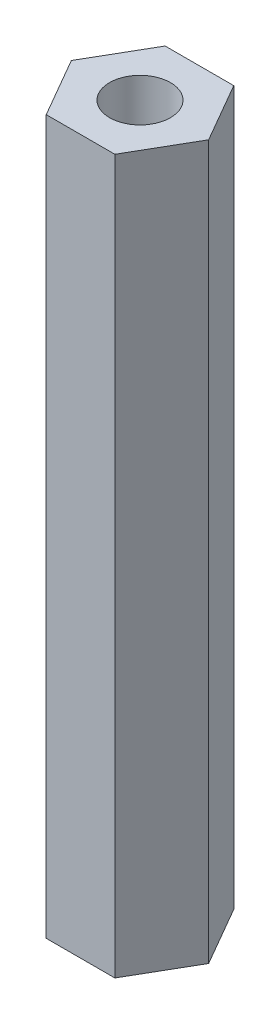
ISO-10303-21;
HEADER;
FILE_DESCRIPTION(('STEP AP214'),'2;1');
FILE_NAME('part.step','',(''),(''),'','','');
FILE_SCHEMA(('AUTOMOTIVE_DESIGN { 1 0 10303 214 1 1 1 1 }'));
ENDSEC;
DATA;
#1=APPLICATION_CONTEXT('core data for automotive mechanical design processes');
#2=APPLICATION_PROTOCOL_DEFINITION('international standard','automotive_design',2000,#1);
#3=PRODUCT_CONTEXT('',#1,'mechanical');
#4=PRODUCT('Part','Part','',(#3));
#5=PRODUCT_RELATED_PRODUCT_CATEGORY('part','',(#4));
#6=PRODUCT_DEFINITION_FORMATION('','',#4);
#7=PRODUCT_DEFINITION_CONTEXT('part definition',#1,'design');
#8=PRODUCT_DEFINITION('design','',#6,#7);
#9=PRODUCT_DEFINITION_SHAPE('','',#8);
#10=(LENGTH_UNIT() NAMED_UNIT(*) SI_UNIT(.MILLI.,.METRE.));
#11=(NAMED_UNIT(*) PLANE_ANGLE_UNIT() SI_UNIT($,.RADIAN.));
#12=(NAMED_UNIT(*) SI_UNIT($,.STERADIAN.) SOLID_ANGLE_UNIT());
#13=UNCERTAINTY_MEASURE_WITH_UNIT(LENGTH_MEASURE(1.E-05),#10,'distance_accuracy_value','');
#14=(GEOMETRIC_REPRESENTATION_CONTEXT(3) GLOBAL_UNCERTAINTY_ASSIGNED_CONTEXT((#13)) GLOBAL_UNIT_ASSIGNED_CONTEXT((#10,
#11,#12)) REPRESENTATION_CONTEXT('',''));
#15=CARTESIAN_POINT('',(0.,0.,0.));
#16=DIRECTION('',(0.,0.,1.));
#17=DIRECTION('',(1.,0.,0.));
#18=AXIS2_PLACEMENT_3D('',#15,#16,#17);
#19=CARTESIAN_POINT('',(0.,38.1,0.));
#20=DIRECTION('',(0.,1.,0.));
#21=DIRECTION('',(0.,0.,1.));
#22=AXIS2_PLACEMENT_3D('',#19,#20,#21);
#23=PLANE('',#22);
#24=DIRECTION('',(-0.500000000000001,0.,-0.866025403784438));
#25=VECTOR('',#24,1.);
#26=CARTESIAN_POINT('',(3.66617420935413,38.1,0.));
#27=LINE('',#26,#25);
#28=CARTESIAN_POINT('',(3.66617420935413,38.1,0.));
#29=VERTEX_POINT('',#28);
#30=CARTESIAN_POINT('',(1.83308710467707,38.1,-3.175));
#31=VERTEX_POINT('',#30);
#32=EDGE_CURVE('E129',#29,#31,#27,.T.);
#33=ORIENTED_EDGE('',*,*,#32,.T.);
#34=DIRECTION('',(-1.,0.,0.));
#35=VECTOR('',#34,1.);
#36=CARTESIAN_POINT('',(1.83308710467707,38.1,-3.175));
#37=LINE('',#36,#35);
#38=CARTESIAN_POINT('',(-1.83308710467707,38.1,-3.175));
#39=VERTEX_POINT('',#38);
#40=EDGE_CURVE('E87',#31,#39,#37,.T.);
#41=ORIENTED_EDGE('',*,*,#40,.T.);
#42=DIRECTION('',(-0.500000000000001,0.,0.866025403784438));
#43=VECTOR('',#42,1.);
#44=CARTESIAN_POINT('',(-1.83308710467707,38.1,-3.175));
#45=LINE('',#44,#43);
#46=CARTESIAN_POINT('',(-3.66617420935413,38.1,0.));
#47=VERTEX_POINT('',#46);
#48=EDGE_CURVE('E100',#39,#47,#45,.T.);
#49=ORIENTED_EDGE('',*,*,#48,.T.);
#50=DIRECTION('',(0.5,0.,0.866025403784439));
#51=VECTOR('',#50,1.);
#52=CARTESIAN_POINT('',(-3.66617420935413,38.1,0.));
#53=LINE('',#52,#51);
#54=CARTESIAN_POINT('',(-1.83308710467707,38.1,3.175));
#55=VERTEX_POINT('',#54);
#56=EDGE_CURVE('E94',#47,#55,#53,.T.);
#57=ORIENTED_EDGE('',*,*,#56,.T.);
#58=DIRECTION('',(1.,0.,0.));
#59=VECTOR('',#58,1.);
#60=CARTESIAN_POINT('',(-1.83308710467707,38.1,3.175));
#61=LINE('',#60,#59);
#62=CARTESIAN_POINT('',(1.83308710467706,38.1,3.175));
#63=VERTEX_POINT('',#62);
#64=EDGE_CURVE('E98',#55,#63,#61,.T.);
#65=ORIENTED_EDGE('',*,*,#64,.T.);
#66=DIRECTION('',(0.500000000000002,0.,-0.866025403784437));
#67=VECTOR('',#66,1.);
#68=CARTESIAN_POINT('',(1.83308710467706,38.1,3.175));
#69=LINE('',#68,#67);
#70=EDGE_CURVE('E50',#63,#29,#69,.T.);
#71=ORIENTED_EDGE('',*,*,#70,.T.);
#72=EDGE_LOOP('',(#33,#41,#49,#57,#65,#71));
#73=FACE_BOUND('',#72,.T.);
#74=CARTESIAN_POINT('',(0.,38.1,0.));
#75=DIRECTION('',(0.,1.,0.));
#76=DIRECTION('',(0.,0.,1.));
#77=AXIS2_PLACEMENT_3D('',#74,#75,#76);
#78=CIRCLE('',#77,1.6256);
#79=CARTESIAN_POINT('',(0.,38.1,-1.6256));
#80=VERTEX_POINT('',#79);
#81=EDGE_CURVE('E122',#80,#80,#78,.T.);
#82=ORIENTED_EDGE('',*,*,#81,.F.);
#83=EDGE_LOOP('',(#82));
#84=FACE_BOUND('',#83,.T.);
#85=ADVANCED_FACE('F33',(#73,#84),#23,.T.);
#86=CARTESIAN_POINT('',(0.,0.,0.));
#87=DIRECTION('',(0.,1.,0.));
#88=DIRECTION('',(0.,0.,1.));
#89=AXIS2_PLACEMENT_3D('',#86,#87,#88);
#90=PLANE('',#89);
#91=DIRECTION('',(-0.500000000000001,0.,-0.866025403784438));
#92=VECTOR('',#91,1.);
#93=CARTESIAN_POINT('',(3.66617420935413,0.,0.));
#94=LINE('',#93,#92);
#95=CARTESIAN_POINT('',(3.66617420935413,0.,0.));
#96=VERTEX_POINT('',#95);
#97=CARTESIAN_POINT('',(1.83308710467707,0.,-3.175));
#98=VERTEX_POINT('',#97);
#99=EDGE_CURVE('E118',#96,#98,#94,.T.);
#100=ORIENTED_EDGE('',*,*,#99,.F.);
#101=DIRECTION('',(0.500000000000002,0.,-0.866025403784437));
#102=VECTOR('',#101,1.);
#103=CARTESIAN_POINT('',(1.83308710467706,0.,3.175));
#104=LINE('',#103,#102);
#105=CARTESIAN_POINT('',(1.83308710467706,0.,3.175));
#106=VERTEX_POINT('',#105);
#107=EDGE_CURVE('E79',#106,#96,#104,.T.);
#108=ORIENTED_EDGE('',*,*,#107,.F.);
#109=DIRECTION('',(1.,0.,0.));
#110=VECTOR('',#109,1.);
#111=CARTESIAN_POINT('',(-1.83308710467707,0.,3.175));
#112=LINE('',#111,#110);
#113=CARTESIAN_POINT('',(-1.83308710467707,0.,3.175));
#114=VERTEX_POINT('',#113);
#115=EDGE_CURVE('E73',#114,#106,#112,.T.);
#116=ORIENTED_EDGE('',*,*,#115,.F.);
#117=DIRECTION('',(0.5,0.,0.866025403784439));
#118=VECTOR('',#117,1.);
#119=CARTESIAN_POINT('',(-3.66617420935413,0.,0.));
#120=LINE('',#119,#118);
#121=CARTESIAN_POINT('',(-3.66617420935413,0.,0.));
#122=VERTEX_POINT('',#121);
#123=EDGE_CURVE('E108',#122,#114,#120,.T.);
#124=ORIENTED_EDGE('',*,*,#123,.F.);
#125=DIRECTION('',(-0.500000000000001,0.,0.866025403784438));
#126=VECTOR('',#125,1.);
#127=CARTESIAN_POINT('',(-1.83308710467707,0.,-3.175));
#128=LINE('',#127,#126);
#129=CARTESIAN_POINT('',(-1.83308710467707,0.,-3.175));
#130=VERTEX_POINT('',#129);
#131=EDGE_CURVE('E124',#130,#122,#128,.T.);
#132=ORIENTED_EDGE('',*,*,#131,.F.);
#133=DIRECTION('',(-1.,0.,0.));
#134=VECTOR('',#133,1.);
#135=CARTESIAN_POINT('',(1.83308710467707,0.,-3.175));
#136=LINE('',#135,#134);
#137=EDGE_CURVE('E121',#98,#130,#136,.T.);
#138=ORIENTED_EDGE('',*,*,#137,.F.);
#139=EDGE_LOOP('',(#100,#108,#116,#124,#132,#138));
#140=FACE_BOUND('',#139,.T.);
#141=CARTESIAN_POINT('',(0.,0.,0.));
#142=DIRECTION('',(0.,1.,0.));
#143=DIRECTION('',(0.,0.,1.));
#144=AXIS2_PLACEMENT_3D('',#141,#142,#143);
#145=CIRCLE('',#144,1.6256);
#146=CARTESIAN_POINT('',(0.,0.,-1.6256));
#147=VERTEX_POINT('',#146);
#148=EDGE_CURVE('E222',#147,#147,#145,.T.);
#149=ORIENTED_EDGE('',*,*,#148,.T.);
#150=EDGE_LOOP('',(#149));
#151=FACE_BOUND('',#150,.T.);
#152=ADVANCED_FACE('F138',(#140,#151),#90,.F.);
#153=CARTESIAN_POINT('',(3.66617420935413,38.1,0.));
#154=DIRECTION('',(-0.866025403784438,0.,0.500000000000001));
#155=DIRECTION('',(0.500000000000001,0.,0.866025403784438));
#156=AXIS2_PLACEMENT_3D('',#153,#154,#155);
#157=PLANE('',#156);
#158=ORIENTED_EDGE('',*,*,#99,.T.);
#159=DIRECTION('',(0.,-1.,0.));
#160=VECTOR('',#159,1.);
#161=CARTESIAN_POINT('',(1.83308710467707,38.1,-3.175));
#162=LINE('',#161,#160);
#163=EDGE_CURVE('E11',#31,#98,#162,.T.);
#164=ORIENTED_EDGE('',*,*,#163,.F.);
#165=ORIENTED_EDGE('',*,*,#32,.F.);
#166=DIRECTION('',(0.,-1.,0.));
#167=VECTOR('',#166,1.);
#168=CARTESIAN_POINT('',(3.66617420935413,38.1,0.));
#169=LINE('',#168,#167);
#170=EDGE_CURVE('E114',#29,#96,#169,.T.);
#171=ORIENTED_EDGE('',*,*,#170,.T.);
#172=EDGE_LOOP('',(#158,#164,#165,#171));
#173=FACE_BOUND('',#172,.T.);
#174=ADVANCED_FACE('F35',(#173),#157,.F.);
#175=CARTESIAN_POINT('',(1.83308710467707,38.1,-3.175));
#176=DIRECTION('',(0.,0.,1.));
#177=DIRECTION('',(1.,0.,0.));
#178=AXIS2_PLACEMENT_3D('',#175,#176,#177);
#179=PLANE('',#178);
#180=ORIENTED_EDGE('',*,*,#137,.T.);
#181=DIRECTION('',(0.,-1.,0.));
#182=VECTOR('',#181,1.);
#183=CARTESIAN_POINT('',(-1.83308710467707,38.1,-3.175));
#184=LINE('',#183,#182);
#185=EDGE_CURVE('E42',#39,#130,#184,.T.);
#186=ORIENTED_EDGE('',*,*,#185,.F.);
#187=ORIENTED_EDGE('',*,*,#40,.F.);
#188=ORIENTED_EDGE('',*,*,#163,.T.);
#189=EDGE_LOOP('',(#180,#186,#187,#188));
#190=FACE_BOUND('',#189,.T.);
#191=ADVANCED_FACE('F163',(#190),#179,.F.);
#192=CARTESIAN_POINT('',(-1.83308710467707,38.1,-3.175));
#193=DIRECTION('',(0.866025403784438,0.,0.500000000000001));
#194=DIRECTION('',(0.500000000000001,0.,-0.866025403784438));
#195=AXIS2_PLACEMENT_3D('',#192,#193,#194);
#196=PLANE('',#195);
#197=ORIENTED_EDGE('',*,*,#131,.T.);
#198=DIRECTION('',(0.,-1.,0.));
#199=VECTOR('',#198,1.);
#200=CARTESIAN_POINT('',(-3.66617420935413,38.1,0.));
#201=LINE('',#200,#199);
#202=EDGE_CURVE('E109',#47,#122,#201,.T.);
#203=ORIENTED_EDGE('',*,*,#202,.F.);
#204=ORIENTED_EDGE('',*,*,#48,.F.);
#205=ORIENTED_EDGE('',*,*,#185,.T.);
#206=EDGE_LOOP('',(#197,#203,#204,#205));
#207=FACE_BOUND('',#206,.T.);
#208=ADVANCED_FACE('F135',(#207),#196,.F.);
#209=CARTESIAN_POINT('',(-3.66617420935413,38.1,0.));
#210=DIRECTION('',(0.866025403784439,0.,-0.5));
#211=DIRECTION('',(-0.5,0.,-0.866025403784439));
#212=AXIS2_PLACEMENT_3D('',#209,#210,#211);
#213=PLANE('',#212);
#214=ORIENTED_EDGE('',*,*,#123,.T.);
#215=DIRECTION('',(0.,-1.,0.));
#216=VECTOR('',#215,1.);
#217=CARTESIAN_POINT('',(-1.83308710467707,38.1,3.175));
#218=LINE('',#217,#216);
#219=EDGE_CURVE('E105',#55,#114,#218,.T.);
#220=ORIENTED_EDGE('',*,*,#219,.F.);
#221=ORIENTED_EDGE('',*,*,#56,.F.);
#222=ORIENTED_EDGE('',*,*,#202,.T.);
#223=EDGE_LOOP('',(#214,#220,#221,#222));
#224=FACE_BOUND('',#223,.T.);
#225=ADVANCED_FACE('F106',(#224),#213,.F.);
#226=CARTESIAN_POINT('',(-1.83308710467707,38.1,3.175));
#227=DIRECTION('',(0.,0.,-1.));
#228=DIRECTION('',(-1.,0.,0.));
#229=AXIS2_PLACEMENT_3D('',#226,#227,#228);
#230=PLANE('',#229);
#231=ORIENTED_EDGE('',*,*,#115,.T.);
#232=DIRECTION('',(0.,-1.,0.));
#233=VECTOR('',#232,1.);
#234=CARTESIAN_POINT('',(1.83308710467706,38.1,3.175));
#235=LINE('',#234,#233);
#236=EDGE_CURVE('E110',#63,#106,#235,.T.);
#237=ORIENTED_EDGE('',*,*,#236,.F.);
#238=ORIENTED_EDGE('',*,*,#64,.F.);
#239=ORIENTED_EDGE('',*,*,#219,.T.);
#240=EDGE_LOOP('',(#231,#237,#238,#239));
#241=FACE_BOUND('',#240,.T.);
#242=ADVANCED_FACE('F112',(#241),#230,.F.);
#243=CARTESIAN_POINT('',(1.83308710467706,38.1,3.175));
#244=DIRECTION('',(-0.866025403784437,0.,-0.500000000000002));
#245=DIRECTION('',(-0.500000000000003,0.,0.866025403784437));
#246=AXIS2_PLACEMENT_3D('',#243,#244,#245);
#247=PLANE('',#246);
#248=ORIENTED_EDGE('',*,*,#107,.T.);
#249=ORIENTED_EDGE('',*,*,#170,.F.);
#250=ORIENTED_EDGE('',*,*,#70,.F.);
#251=ORIENTED_EDGE('',*,*,#236,.T.);
#252=EDGE_LOOP('',(#248,#249,#250,#251));
#253=FACE_BOUND('',#252,.T.);
#254=ADVANCED_FACE('F143',(#253),#247,.F.);
#255=CARTESIAN_POINT('',(0.,38.1,0.));
#256=DIRECTION('',(0.,-1.,0.));
#257=DIRECTION('',(0.,0.,-1.));
#258=AXIS2_PLACEMENT_3D('',#255,#256,#257);
#259=CYLINDRICAL_SURFACE('',#258,1.6256);
#260=CARTESIAN_POINT('',(0.,38.1,-1.6256));
#261=CARTESIAN_POINT('',(0.,37.703125,-1.6256));
#262=CARTESIAN_POINT('',(0.,37.30625,-1.6256));
#263=CARTESIAN_POINT('',(0.,36.5125,-1.6256));
#264=CARTESIAN_POINT('',(0.,36.115625,-1.6256));
#265=CARTESIAN_POINT('',(0.,35.321875,-1.6256));
#266=CARTESIAN_POINT('',(0.,34.925,-1.6256));
#267=CARTESIAN_POINT('',(0.,34.13125,-1.6256));
#268=CARTESIAN_POINT('',(0.,33.734375,-1.6256));
#269=CARTESIAN_POINT('',(0.,32.940625,-1.6256));
#270=CARTESIAN_POINT('',(0.,32.54375,-1.6256));
#271=CARTESIAN_POINT('',(0.,31.75,-1.6256));
#272=CARTESIAN_POINT('',(0.,31.353125,-1.6256));
#273=CARTESIAN_POINT('',(0.,30.559375,-1.6256));
#274=CARTESIAN_POINT('',(0.,30.1625,-1.6256));
#275=CARTESIAN_POINT('',(0.,29.36875,-1.6256));
#276=CARTESIAN_POINT('',(0.,28.971875,-1.6256));
#277=CARTESIAN_POINT('',(0.,28.178125,-1.6256));
#278=CARTESIAN_POINT('',(0.,27.78125,-1.6256));
#279=CARTESIAN_POINT('',(0.,26.9875,-1.6256));
#280=CARTESIAN_POINT('',(0.,26.590625,-1.6256));
#281=CARTESIAN_POINT('',(0.,25.796875,-1.6256));
#282=CARTESIAN_POINT('',(0.,25.4,-1.6256));
#283=CARTESIAN_POINT('',(0.,24.60625,-1.6256));
#284=CARTESIAN_POINT('',(0.,24.209375,-1.6256));
#285=CARTESIAN_POINT('',(0.,23.415625,-1.6256));
#286=CARTESIAN_POINT('',(0.,23.01875,-1.6256));
#287=CARTESIAN_POINT('',(0.,22.225,-1.6256));
#288=CARTESIAN_POINT('',(0.,21.828125,-1.6256));
#289=CARTESIAN_POINT('',(0.,21.034375,-1.6256));
#290=CARTESIAN_POINT('',(0.,20.6375,-1.6256));
#291=CARTESIAN_POINT('',(0.,19.84375,-1.6256));
#292=CARTESIAN_POINT('',(0.,19.446875,-1.6256));
#293=CARTESIAN_POINT('',(0.,18.653125,-1.6256));
#294=CARTESIAN_POINT('',(0.,18.25625,-1.6256));
#295=CARTESIAN_POINT('',(0.,17.4625,-1.6256));
#296=CARTESIAN_POINT('',(0.,17.065625,-1.6256));
#297=CARTESIAN_POINT('',(0.,16.271875,-1.6256));
#298=CARTESIAN_POINT('',(0.,15.875,-1.6256));
#299=CARTESIAN_POINT('',(0.,15.08125,-1.6256));
#300=CARTESIAN_POINT('',(0.,14.684375,-1.6256));
#301=CARTESIAN_POINT('',(0.,13.890625,-1.6256));
#302=CARTESIAN_POINT('',(0.,13.49375,-1.6256));
#303=CARTESIAN_POINT('',(0.,12.7,-1.6256));
#304=CARTESIAN_POINT('',(0.,12.303125,-1.6256));
#305=CARTESIAN_POINT('',(0.,11.509375,-1.6256));
#306=CARTESIAN_POINT('',(0.,11.1125,-1.6256));
#307=CARTESIAN_POINT('',(0.,10.31875,-1.6256));
#308=CARTESIAN_POINT('',(0.,9.921875,-1.6256));
#309=CARTESIAN_POINT('',(0.,9.128125,-1.6256));
#310=CARTESIAN_POINT('',(0.,8.73125,-1.6256));
#311=CARTESIAN_POINT('',(0.,7.9375,-1.6256));
#312=CARTESIAN_POINT('',(0.,7.540625,-1.6256));
#313=CARTESIAN_POINT('',(0.,6.746875,-1.6256));
#314=CARTESIAN_POINT('',(0.,6.35,-1.6256));
#315=CARTESIAN_POINT('',(0.,5.55625,-1.6256));
#316=CARTESIAN_POINT('',(0.,5.159375,-1.6256));
#317=CARTESIAN_POINT('',(0.,4.365625,-1.6256));
#318=CARTESIAN_POINT('',(0.,3.96875,-1.6256));
#319=CARTESIAN_POINT('',(0.,3.175,-1.6256));
#320=CARTESIAN_POINT('',(0.,2.778125,-1.6256));
#321=CARTESIAN_POINT('',(0.,1.984375,-1.6256));
#322=CARTESIAN_POINT('',(0.,1.5875,-1.6256));
#323=CARTESIAN_POINT('',(0.,0.79375,-1.6256));
#324=CARTESIAN_POINT('',(0.,0.396875,-1.6256));
#325=CARTESIAN_POINT('',(0.,0.,-1.6256));
#326=B_SPLINE_CURVE_WITH_KNOTS('',3,(#260,#261,#262,#263,#264,#265,#266,#267,#268,#269,#270,
#271,#272,#273,#274,#275,#276,#277,#278,#279,#280,#281,#282,#283,#284,#285,#286,#287,#288,#289,
#290,#291,#292,#293,#294,#295,#296,#297,#298,#299,#300,#301,#302,#303,#304,#305,#306,#307,#308,
#309,#310,#311,#312,#313,#314,#315,#316,#317,#318,#319,#320,#321,#322,#323,#324,#325),
.UNSPECIFIED.,.F.,.F.,(4,2,2,2,2,2,2,2,2,2,2,2,2,2,2,2,2,2,2,2,2,2,2,2,2,2,2,2,2,2,2,2,4),(0.,
1.19062499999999,2.38124999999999,3.571875,4.7625,5.953125,7.14375,8.33437499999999,9.525,
10.715625,11.90625,13.096875,14.2875,15.478125,16.66875,17.859375,19.05,20.240625,21.43125,
22.621875,23.8125,25.003125,26.19375,27.384375,28.575,29.765625,30.95625,32.146875,33.3375,
34.528125,35.71875,36.909375,38.1),.UNSPECIFIED.);
#327=EDGE_CURVE('BSEAM145',#80,#147,#326,.T.);
#328=ORIENTED_EDGE('',*,*,#81,.T.);
#329=ORIENTED_EDGE('',*,*,#148,.F.);
#330=ORIENTED_EDGE('',*,*,#327,.T.);
#331=ORIENTED_EDGE('',*,*,#327,.F.);
#332=EDGE_LOOP('',(#328,#330,#329,#331));
#333=FACE_BOUND('',#332,.T.);
#334=ADVANCED_FACE('F145',(#333),#259,.F.);
#335=CLOSED_SHELL('',(#85,#152,#174,#191,#208,#225,#242,#254,#334));
#336=MANIFOLD_SOLID_BREP('B2',#335);
#337=ADVANCED_BREP_SHAPE_REPRESENTATION('',(#18,#336),#14);
#338=SHAPE_DEFINITION_REPRESENTATION(#9,#337);
ENDSEC;
END-ISO-10303-21;
